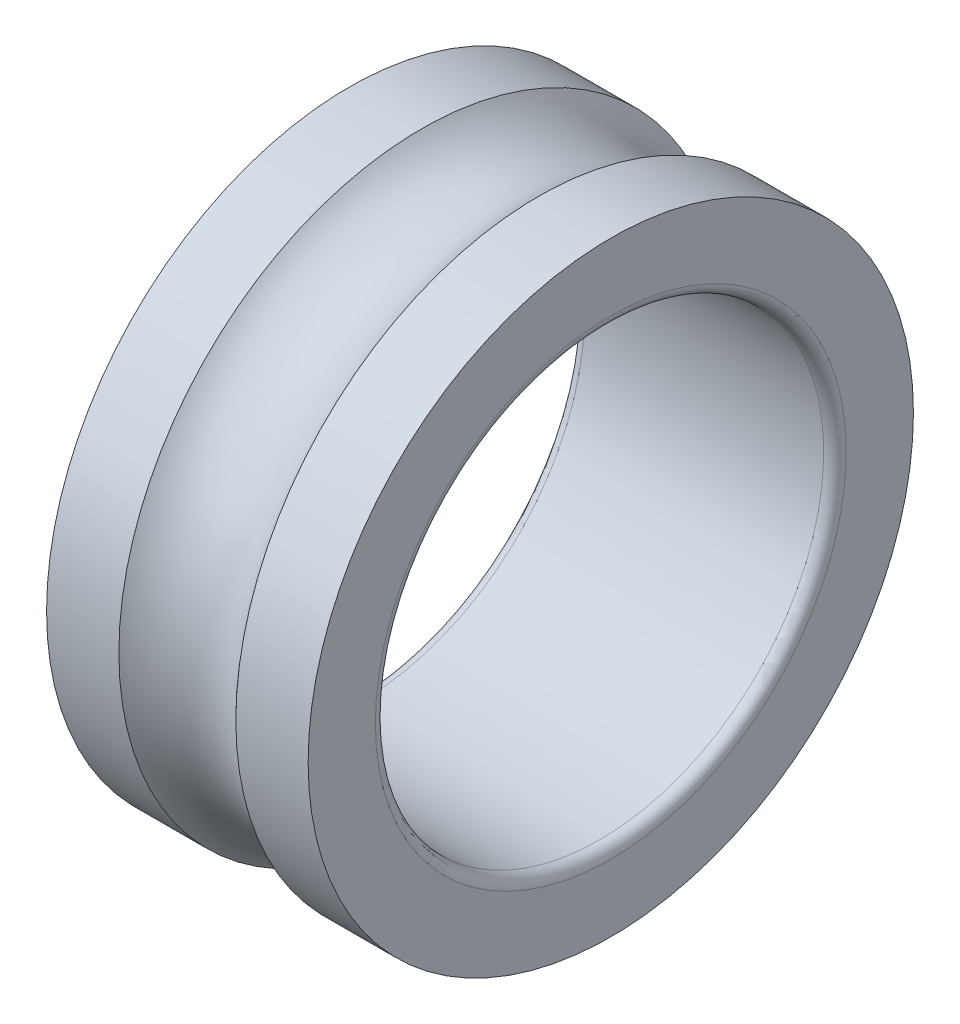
from build123d import *


with BuildPart() as part:
    # Esquisse1 → Base-R_volution (revolve)
    with BuildSketch(Plane(origin=(0, 0, 0), x_dir=(1, 0, 0), z_dir=(0, 1, 0)), mode=Mode.PRIVATE) as base_r_volution_sk:
        with BuildLine():
            Line((0, 4.05), (0, 3.15))
            ThreePointArc((0, 3.15), (0.043933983, 3.043933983), (0.15, 3))
            Line((0.15, 3), (3.35, 3))
            ThreePointArc((3.35, 3), (3.456066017, 3.043933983), (3.5, 3.15))
            Line((3.5, 3.15), (3.5, 4.05))
            Line((3.5, 4.05), (2.532623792, 4.05))
            ThreePointArc((2.532623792, 4.05), (1.75, 3.7), (0.967376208, 4.05))
            Line((0.967376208, 4.05), (0, 4.05))
        make_face()
    revolve(base_r_volution_sk.sketch.rotate(Axis((0, 0, 0), (1, 0, 0)), 180), axis=Axis((0, 0, 0), (1, 0, 0)))


solid = part.part
